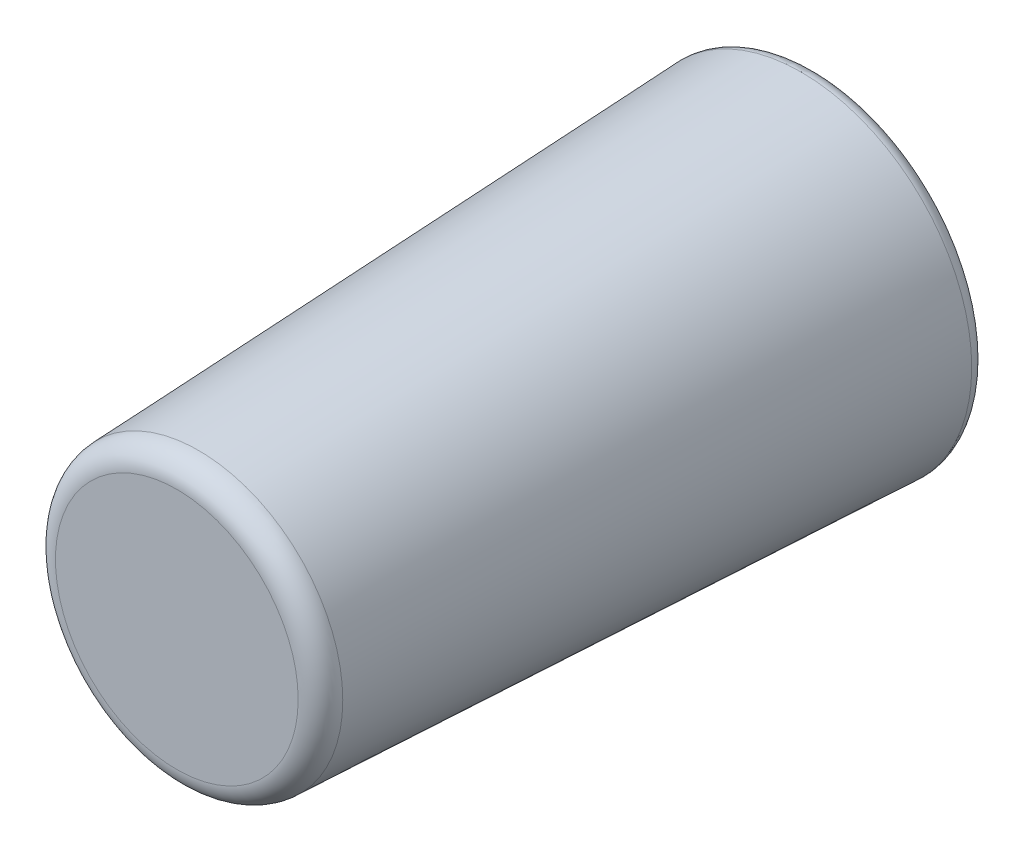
ISO-10303-21;
HEADER;
FILE_DESCRIPTION(('STEP AP214'),'2;1');
FILE_NAME('part.step','',(''),(''),'','','');
FILE_SCHEMA(('AUTOMOTIVE_DESIGN { 1 0 10303 214 1 1 1 1 }'));
ENDSEC;
DATA;
#1=APPLICATION_CONTEXT('core data for automotive mechanical design processes');
#2=APPLICATION_PROTOCOL_DEFINITION('international standard','automotive_design',2000,#1);
#3=PRODUCT_CONTEXT('',#1,'mechanical');
#4=PRODUCT('Part','Part','',(#3));
#5=PRODUCT_RELATED_PRODUCT_CATEGORY('part','',(#4));
#6=PRODUCT_DEFINITION_FORMATION('','',#4);
#7=PRODUCT_DEFINITION_CONTEXT('part definition',#1,'design');
#8=PRODUCT_DEFINITION('design','',#6,#7);
#9=PRODUCT_DEFINITION_SHAPE('','',#8);
#10=(LENGTH_UNIT() NAMED_UNIT(*) SI_UNIT(.MILLI.,.METRE.));
#11=(NAMED_UNIT(*) PLANE_ANGLE_UNIT() SI_UNIT($,.RADIAN.));
#12=(NAMED_UNIT(*) SI_UNIT($,.STERADIAN.) SOLID_ANGLE_UNIT());
#13=UNCERTAINTY_MEASURE_WITH_UNIT(LENGTH_MEASURE(1.E-05),#10,'distance_accuracy_value','');
#14=(GEOMETRIC_REPRESENTATION_CONTEXT(3) GLOBAL_UNCERTAINTY_ASSIGNED_CONTEXT((#13)) GLOBAL_UNIT_ASSIGNED_CONTEXT((#10,
#11,#12)) REPRESENTATION_CONTEXT('',''));
#15=CARTESIAN_POINT('',(0.,0.,0.));
#16=DIRECTION('',(0.,0.,1.));
#17=DIRECTION('',(1.,0.,0.));
#18=AXIS2_PLACEMENT_3D('',#15,#16,#17);
#19=CARTESIAN_POINT('',(0.,0.,0.));
#20=DIRECTION('',(0.,0.,-1.));
#21=DIRECTION('',(1.,0.,0.));
#22=AXIS2_PLACEMENT_3D('',#19,#20,#21);
#23=CONICAL_SURFACE('',#22,9.525,0.0436332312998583);
#24=CARTESIAN_POINT('',(0.,0.,0.795237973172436));
#25=DIRECTION('',(0.,0.,1.));
#26=DIRECTION('',(1.,0.,0.));
#27=AXIS2_PLACEMENT_3D('',#24,#25,#26);
#28=CIRCLE('',#27,9.49027916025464);
#29=CARTESIAN_POINT('',(9.49027916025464,0.,0.795237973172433));
#30=VERTEX_POINT('',#29);
#31=EDGE_CURVE('E43',#30,#30,#28,.T.);
#32=ORIENTED_EDGE('',*,*,#31,.T.);
#33=EDGE_LOOP('',(#32));
#34=FACE_BOUND('',#33,.T.);
#35=CARTESIAN_POINT('',(0.,0.,34.345396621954));
#36=DIRECTION('',(0.,0.,-1.));
#37=DIRECTION('',(-1.,0.,0.));
#38=AXIS2_PLACEMENT_3D('',#35,#36,#37);
#39=CIRCLE('',#38,8.02544759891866);
#40=CARTESIAN_POINT('',(-8.02544759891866,0.,34.345396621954));
#41=VERTEX_POINT('',#40);
#42=EDGE_CURVE('E48',#41,#41,#39,.T.);
#43=ORIENTED_EDGE('',*,*,#42,.T.);
#44=EDGE_LOOP('',(#43));
#45=FACE_BOUND('',#44,.T.);
#46=ADVANCED_FACE('F29',(#34,#45),#23,.T.);
#47=CARTESIAN_POINT('',(0.,0.,35.56));
#48=DIRECTION('',(0.,0.,1.));
#49=DIRECTION('',(1.,0.,0.));
#50=AXIS2_PLACEMENT_3D('',#47,#48,#49);
#51=PLANE('',#50);
#52=CARTESIAN_POINT('',(0.,0.,35.56));
#53=DIRECTION('',(0.,0.,1.));
#54=DIRECTION('',(1.,0.,0.));
#55=AXIS2_PLACEMENT_3D('',#52,#53,#54);
#56=CIRCLE('',#55,6.7566563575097);
#57=CARTESIAN_POINT('',(6.7566563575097,0.,35.56));
#58=VERTEX_POINT('',#57);
#59=EDGE_CURVE('E51',#58,#58,#56,.T.);
#60=ORIENTED_EDGE('',*,*,#59,.T.);
#61=EDGE_LOOP('',(#60));
#62=FACE_BOUND('',#61,.T.);
#63=ADVANCED_FACE('F97',(#62),#51,.T.);
#64=CARTESIAN_POINT('',(0.,0.,0.));
#65=DIRECTION('',(0.,0.,1.));
#66=DIRECTION('',(1.,0.,0.));
#67=AXIS2_PLACEMENT_3D('',#64,#65,#66);
#68=PLANE('',#67);
#69=CARTESIAN_POINT('',(0.,0.,0.));
#70=DIRECTION('',(0.,0.,1.));
#71=DIRECTION('',(1.,0.,0.));
#72=AXIS2_PLACEMENT_3D('',#69,#70,#71);
#73=CIRCLE('',#72,8.72900441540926);
#74=CARTESIAN_POINT('',(8.72900441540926,0.,0.));
#75=VERTEX_POINT('',#74);
#76=EDGE_CURVE('E35',#75,#75,#73,.F.);
#77=ORIENTED_EDGE('',*,*,#76,.T.);
#78=EDGE_LOOP('',(#77));
#79=FACE_BOUND('',#78,.T.);
#80=CARTESIAN_POINT('',(0.,0.,0.));
#81=DIRECTION('',(0.,0.,1.));
#82=DIRECTION('',(1.,0.,0.));
#83=AXIS2_PLACEMENT_3D('',#80,#81,#82);
#84=CIRCLE('',#83,8.0645);
#85=CARTESIAN_POINT('',(8.0645,0.,0.));
#86=VERTEX_POINT('',#85);
#87=EDGE_CURVE('E39',#86,#86,#84,.T.);
#88=ORIENTED_EDGE('',*,*,#87,.T.);
#89=EDGE_LOOP('',(#88));
#90=FACE_BOUND('',#89,.T.);
#91=ADVANCED_FACE('F102',(#79,#90),#68,.F.);
#92=CARTESIAN_POINT('',(0.,0.,34.29));
#93=DIRECTION('',(0.,0.,1.));
#94=DIRECTION('',(1.,0.,0.));
#95=AXIS2_PLACEMENT_3D('',#92,#93,#94);
#96=TOROIDAL_SURFACE('',#95,6.7566563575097,1.27);
#97=ORIENTED_EDGE('',*,*,#42,.F.);
#98=EDGE_LOOP('',(#97));
#99=FACE_BOUND('',#98,.T.);
#100=ORIENTED_EDGE('',*,*,#59,.F.);
#101=EDGE_LOOP('',(#100));
#102=FACE_BOUND('',#101,.T.);
#103=ADVANCED_FACE('F108',(#99,#102),#96,.T.);
#104=CARTESIAN_POINT('',(0.,0.,4.445));
#105=DIRECTION('',(0.,0.,-1.));
#106=DIRECTION('',(-1.,0.,0.));
#107=AXIS2_PLACEMENT_3D('',#104,#105,#106);
#108=CYLINDRICAL_SURFACE('',#107,7.3025);
#109=CARTESIAN_POINT('',(0.,0.,0.761999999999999));
#110=DIRECTION('',(0.,0.,1.));
#111=DIRECTION('',(1.,0.,0.));
#112=AXIS2_PLACEMENT_3D('',#109,#110,#111);
#113=CIRCLE('',#112,7.3025);
#114=CARTESIAN_POINT('',(7.3025,0.,0.761999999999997));
#115=VERTEX_POINT('',#114);
#116=EDGE_CURVE('E10',#115,#115,#113,.F.);
#117=ORIENTED_EDGE('',*,*,#116,.T.);
#118=EDGE_LOOP('',(#117));
#119=FACE_BOUND('',#118,.T.);
#120=CARTESIAN_POINT('',(0.,0.,4.445));
#121=DIRECTION('',(0.,0.,-1.));
#122=DIRECTION('',(-1.,0.,0.));
#123=AXIS2_PLACEMENT_3D('',#120,#121,#122);
#124=CIRCLE('',#123,7.3025);
#125=CARTESIAN_POINT('',(-7.3025,0.,4.445));
#126=VERTEX_POINT('',#125);
#127=EDGE_CURVE('E54',#126,#126,#124,.T.);
#128=ORIENTED_EDGE('',*,*,#127,.F.);
#129=EDGE_LOOP('',(#128));
#130=FACE_BOUND('',#129,.T.);
#131=ADVANCED_FACE('F80',(#119,#130),#108,.F.);
#132=CARTESIAN_POINT('',(0.,0.,-0.044317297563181));
#133=DIRECTION('',(0.,0.,-1.));
#134=DIRECTION('',(1.,0.,0.));
#135=AXIS2_PLACEMENT_3D('',#132,#133,#134);
#136=CONICAL_SURFACE('',#135,8.50996700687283,0.0436332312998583);
#137=CARTESIAN_POINT('',(0.,0.,34.3010793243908));
#138=DIRECTION('',(0.,0.,-1.));
#139=DIRECTION('',(-1.,0.,0.));
#140=AXIS2_PLACEMENT_3D('',#137,#138,#139);
#141=CIRCLE('',#140,7.01041460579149);
#142=CARTESIAN_POINT('',(-7.0104146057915,0.,34.3010793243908));
#143=VERTEX_POINT('',#142);
#144=EDGE_CURVE('E57',#143,#143,#141,.T.);
#145=ORIENTED_EDGE('',*,*,#144,.F.);
#146=EDGE_LOOP('',(#145));
#147=FACE_BOUND('',#146,.T.);
#148=CARTESIAN_POINT('',(0.,0.,1.016));
#149=DIRECTION('',(0.,0.,1.));
#150=DIRECTION('',(1.,0.,0.));
#151=AXIS2_PLACEMENT_3D('',#148,#149,#150);
#152=CIRCLE('',#151,8.46367255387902);
#153=CARTESIAN_POINT('',(8.46367255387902,0.,1.016));
#154=VERTEX_POINT('',#153);
#155=EDGE_CURVE('E61',#154,#154,#152,.T.);
#156=ORIENTED_EDGE('',*,*,#155,.F.);
#157=EDGE_LOOP('',(#156));
#158=FACE_BOUND('',#157,.T.);
#159=ADVANCED_FACE('F76',(#147,#158),#136,.F.);
#160=CARTESIAN_POINT('',(0.,0.,34.544));
#161=DIRECTION('',(0.,0.,1.));
#162=DIRECTION('',(1.,0.,0.));
#163=AXIS2_PLACEMENT_3D('',#160,#161,#162);
#164=PLANE('',#163);
#165=CARTESIAN_POINT('',(0.,0.,34.544));
#166=DIRECTION('',(0.,0.,1.));
#167=DIRECTION('',(1.,0.,0.));
#168=AXIS2_PLACEMENT_3D('',#165,#166,#167);
#169=CIRCLE('',#168,6.7566563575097);
#170=CARTESIAN_POINT('',(6.7566563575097,0.,34.544));
#171=VERTEX_POINT('',#170);
#172=EDGE_CURVE('E63',#171,#171,#169,.T.);
#173=ORIENTED_EDGE('',*,*,#172,.F.);
#174=EDGE_LOOP('',(#173));
#175=FACE_BOUND('',#174,.T.);
#176=ADVANCED_FACE('F79',(#175),#164,.F.);
#177=CARTESIAN_POINT('',(0.,0.,1.016));
#178=DIRECTION('',(0.,0.,1.));
#179=DIRECTION('',(1.,0.,0.));
#180=AXIS2_PLACEMENT_3D('',#177,#178,#179);
#181=PLANE('',#180);
#182=CARTESIAN_POINT('',(0.,0.,1.016));
#183=DIRECTION('',(0.,0.,1.));
#184=DIRECTION('',(1.,0.,0.));
#185=AXIS2_PLACEMENT_3D('',#182,#183,#184);
#186=CIRCLE('',#185,8.3185);
#187=CARTESIAN_POINT('',(8.3185,0.,1.016));
#188=VERTEX_POINT('',#187);
#189=EDGE_CURVE('E62',#188,#188,#186,.F.);
#190=ORIENTED_EDGE('',*,*,#189,.T.);
#191=EDGE_LOOP('',(#190));
#192=FACE_BOUND('',#191,.T.);
#193=ORIENTED_EDGE('',*,*,#155,.T.);
#194=EDGE_LOOP('',(#193));
#195=FACE_BOUND('',#194,.T.);
#196=ADVANCED_FACE('F84',(#192,#195),#181,.T.);
#197=CARTESIAN_POINT('',(0.,0.,34.29));
#198=DIRECTION('',(0.,0.,1.));
#199=DIRECTION('',(1.,0.,0.));
#200=AXIS2_PLACEMENT_3D('',#197,#198,#199);
#201=TOROIDAL_SURFACE('',#200,6.7566563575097,0.254);
#202=ORIENTED_EDGE('',*,*,#144,.T.);
#203=EDGE_LOOP('',(#202));
#204=FACE_BOUND('',#203,.T.);
#205=ORIENTED_EDGE('',*,*,#172,.T.);
#206=EDGE_LOOP('',(#205));
#207=FACE_BOUND('',#206,.T.);
#208=ADVANCED_FACE('F73',(#204,#207),#201,.F.);
#209=CARTESIAN_POINT('',(0.,0.,4.445));
#210=DIRECTION('',(0.,0.,-1.));
#211=DIRECTION('',(-1.,0.,0.));
#212=AXIS2_PLACEMENT_3D('',#209,#210,#211);
#213=CYLINDRICAL_SURFACE('',#212,8.3185);
#214=CARTESIAN_POINT('',(0.,0.,4.445));
#215=DIRECTION('',(0.,0.,-1.));
#216=DIRECTION('',(-1.,0.,0.));
#217=AXIS2_PLACEMENT_3D('',#214,#215,#216);
#218=CIRCLE('',#217,8.3185);
#219=CARTESIAN_POINT('',(-8.3185,0.,4.445));
#220=VERTEX_POINT('',#219);
#221=EDGE_CURVE('E58',#220,#220,#218,.T.);
#222=ORIENTED_EDGE('',*,*,#221,.T.);
#223=EDGE_LOOP('',(#222));
#224=FACE_BOUND('',#223,.T.);
#225=ORIENTED_EDGE('',*,*,#189,.F.);
#226=EDGE_LOOP('',(#225));
#227=FACE_BOUND('',#226,.T.);
#228=ADVANCED_FACE('F92',(#224,#227),#213,.T.);
#229=CARTESIAN_POINT('',(0.,0.,4.445));
#230=DIRECTION('',(0.,0.,-1.));
#231=DIRECTION('',(-1.,0.,0.));
#232=AXIS2_PLACEMENT_3D('',#229,#230,#231);
#233=PLANE('',#232);
#234=ORIENTED_EDGE('',*,*,#127,.T.);
#235=EDGE_LOOP('',(#234));
#236=FACE_BOUND('',#235,.T.);
#237=ORIENTED_EDGE('',*,*,#221,.F.);
#238=EDGE_LOOP('',(#237));
#239=FACE_BOUND('',#238,.T.);
#240=ADVANCED_FACE('F121',(#236,#239),#233,.F.);
#241=CARTESIAN_POINT('',(0.,0.,0.761999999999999));
#242=DIRECTION('',(0.,0.,1.));
#243=DIRECTION('',(1.,0.,0.));
#244=AXIS2_PLACEMENT_3D('',#241,#242,#243);
#245=TOROIDAL_SURFACE('',#244,8.72900441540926,0.762);
#246=ORIENTED_EDGE('',*,*,#76,.F.);
#247=EDGE_LOOP('',(#246));
#248=FACE_BOUND('',#247,.T.);
#249=ORIENTED_EDGE('',*,*,#31,.F.);
#250=EDGE_LOOP('',(#249));
#251=FACE_BOUND('',#250,.T.);
#252=ADVANCED_FACE('F126',(#248,#251),#245,.T.);
#253=CARTESIAN_POINT('',(0.,0.,0.761999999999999));
#254=DIRECTION('',(0.,0.,1.));
#255=DIRECTION('',(1.,0.,0.));
#256=AXIS2_PLACEMENT_3D('',#253,#254,#255);
#257=TOROIDAL_SURFACE('',#256,8.0645,0.762);
#258=ORIENTED_EDGE('',*,*,#87,.F.);
#259=EDGE_LOOP('',(#258));
#260=FACE_BOUND('',#259,.T.);
#261=ORIENTED_EDGE('',*,*,#116,.F.);
#262=EDGE_LOOP('',(#261));
#263=FACE_BOUND('',#262,.T.);
#264=ADVANCED_FACE('F136',(#260,#263),#257,.T.);
#265=CLOSED_SHELL('',(#46,#63,#91,#103,#131,#159,#176,#196,#208,#228,#240,#252,#264));
#266=MANIFOLD_SOLID_BREP('B2',#265);
#267=ADVANCED_BREP_SHAPE_REPRESENTATION('',(#18,#266),#14);
#268=SHAPE_DEFINITION_REPRESENTATION(#9,#267);
ENDSEC;
END-ISO-10303-21;
